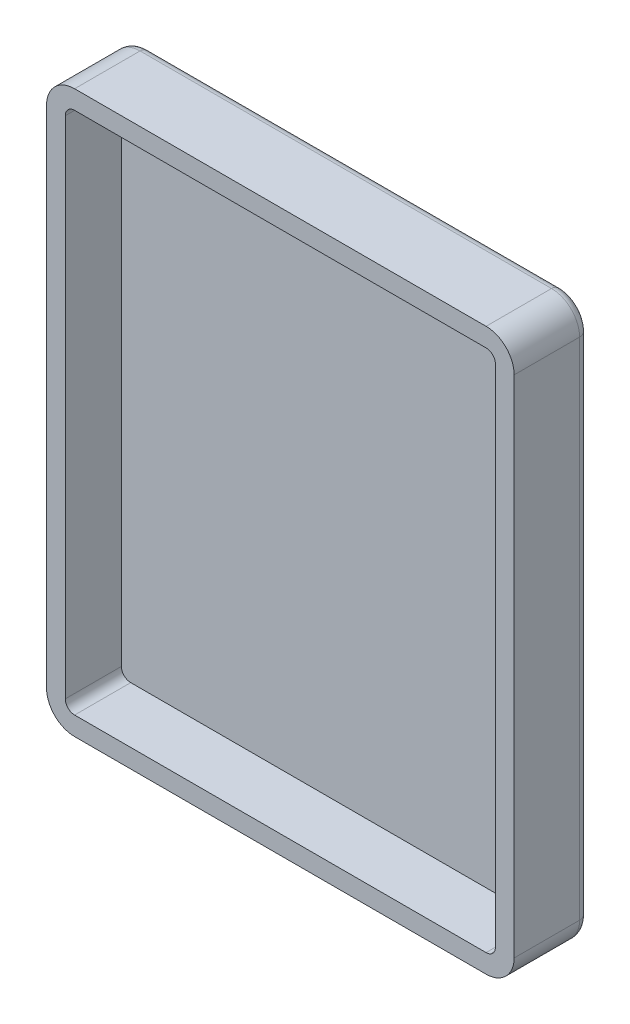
from build123d import *

# Parameters (mm, degrees)
SKETCH1_W           = 50
SKETCH1_H           = 60
BOSS_EXTRUDE1_DEPTH = 8
FILLET1_R           = 3
SHELL1_T            = -4
FILLET4_R           = 1
SKETCH3_OUTSIDE_W   = 67.702
SKETCH3_OUTSIDE_H   = 77.702
CUT_EXTRUDE1_DEPTH  = 6


with BuildPart() as part:
    # Sketch1 → Boss-Extrude1 (new body)
    with BuildSketch(Plane.XY):
        with Locations((25, 30)):
            Rectangle(SKETCH1_W, SKETCH1_H)
    extrude(amount=BOSS_EXTRUDE1_DEPTH)

    # Fillet1
    fillet1_edges = [part.edges().sort_by_distance(p)[0] for p in [
        (0, 60, 4),
        (50, 60, 4),
        (50, 0, 4),
        (0, 0, 4),
    ]]
    fillet(fillet1_edges, radius=FILLET1_R)

    # Shell1
    shell1_openings = [part.faces().sort_by_distance(p)[0] for p in [
        (25, 30, 8),
    ]]
    offset(amount=SHELL1_T, openings=shell1_openings, kind=Kind.INTERSECTION)

    # Fillet4
    fillet4_edges = [part.edges().sort_by_distance(p)[0] for p in [
        (50, 30, 0),
        (0, 30, 0),
        (25, 60, 0),
        (25, 0, 0),
        (49.121320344, 59.121320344, 0),
        (0.878679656, 59.121320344, 0),
        (0.878679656, 0.878679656, 0),
        (49.121320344, 0.878679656, 0),
    ]]
    fillet(fillet4_edges, radius=FILLET4_R)

    # Sketch3 outside → Cut-Extrude1 (cut)
    # profile 1 of 2: a face of its own
    with BuildSketch(Plane.XY.offset(8)):
        with Locations((25, 30)):
            Rectangle(SKETCH3_OUTSIDE_W, SKETCH3_OUTSIDE_H)
        with BuildLine():
            Line((3, 0), (47, 0))
            ThreePointArc((47, 0), (49.121320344, 0.878679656), (50, 3))
            Line((50, 3), (50, 57))
            ThreePointArc((50, 57), (49.121320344, 59.121320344), (47, 60))
            Line((47, 60), (3, 60))
            ThreePointArc((3, 60), (0.878679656, 59.121320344), (0, 57))
            Line((0, 57), (0, 3))
            ThreePointArc((0, 3), (0.878679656, 0.878679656), (3, 0))
        make_face(mode=Mode.SUBTRACT)
    # profile 2 of 2: a face of its own
    with BuildSketch(Plane.XY.offset(8)):
        with BuildLine():
            Line((3, 2), (47, 2))
            ThreePointArc((47, 2), (47.707106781, 2.292893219), (48, 3))
            Line((48, 3), (48, 57))
            ThreePointArc((48, 57), (47.707106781, 57.707106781), (47, 58))
            Line((47, 58), (3, 58))
            ThreePointArc((3, 58), (2.292893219, 57.707106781), (2, 57))
            Line((2, 57), (2, 3))
            ThreePointArc((2, 3), (2.292893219, 2.292893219), (3, 2))
        make_face()
    extrude(amount=-CUT_EXTRUDE1_DEPTH, mode=Mode.SUBTRACT)


solid = part.part
